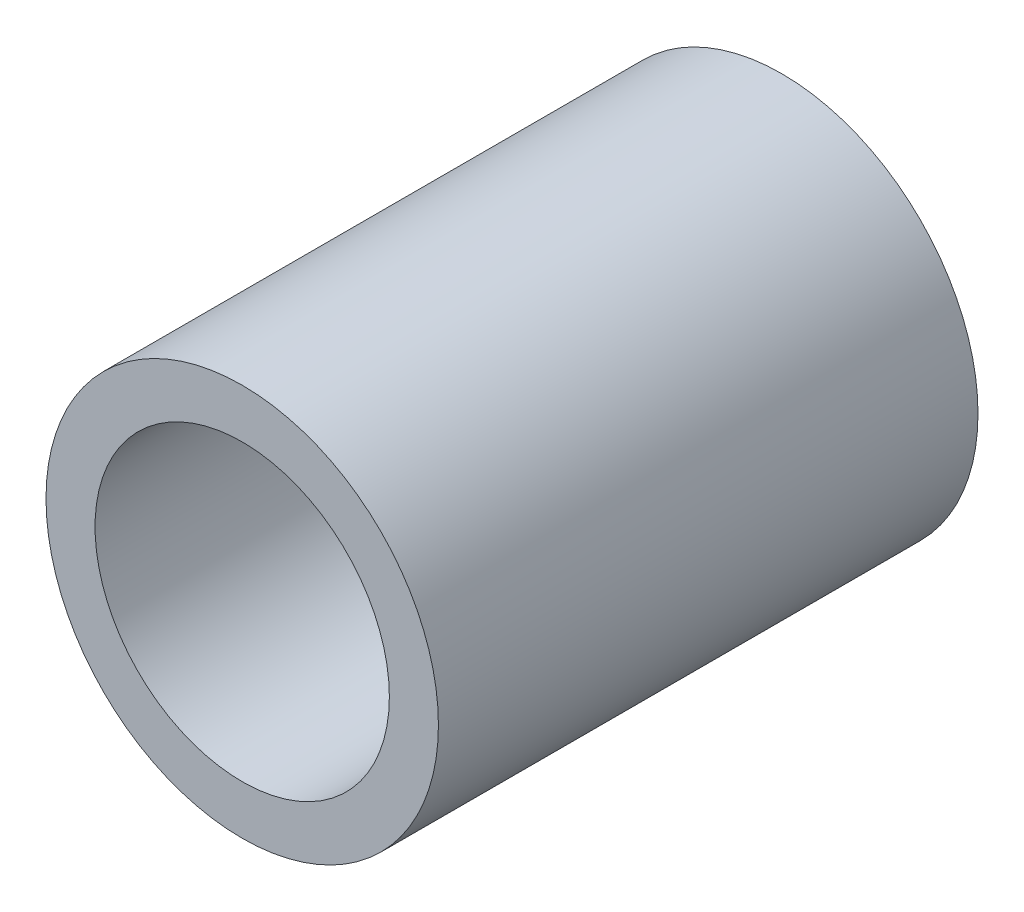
ISO-10303-21;
HEADER;
FILE_DESCRIPTION(('STEP AP214'),'2;1');
FILE_NAME('part.step','',(''),(''),'','','');
FILE_SCHEMA(('AUTOMOTIVE_DESIGN { 1 0 10303 214 1 1 1 1 }'));
ENDSEC;
DATA;
#1=APPLICATION_CONTEXT('core data for automotive mechanical design processes');
#2=APPLICATION_PROTOCOL_DEFINITION('international standard','automotive_design',2000,#1);
#3=PRODUCT_CONTEXT('',#1,'mechanical');
#4=PRODUCT('Part','Part','',(#3));
#5=PRODUCT_RELATED_PRODUCT_CATEGORY('part','',(#4));
#6=PRODUCT_DEFINITION_FORMATION('','',#4);
#7=PRODUCT_DEFINITION_CONTEXT('part definition',#1,'design');
#8=PRODUCT_DEFINITION('design','',#6,#7);
#9=PRODUCT_DEFINITION_SHAPE('','',#8);
#10=(LENGTH_UNIT() NAMED_UNIT(*) SI_UNIT(.MILLI.,.METRE.));
#11=(NAMED_UNIT(*) PLANE_ANGLE_UNIT() SI_UNIT($,.RADIAN.));
#12=(NAMED_UNIT(*) SI_UNIT($,.STERADIAN.) SOLID_ANGLE_UNIT());
#13=UNCERTAINTY_MEASURE_WITH_UNIT(LENGTH_MEASURE(1.E-05),#10,'distance_accuracy_value','');
#14=(GEOMETRIC_REPRESENTATION_CONTEXT(3) GLOBAL_UNCERTAINTY_ASSIGNED_CONTEXT((#13)) GLOBAL_UNIT_ASSIGNED_CONTEXT((#10,
#11,#12)) REPRESENTATION_CONTEXT('',''));
#15=CARTESIAN_POINT('',(0.,0.,0.));
#16=DIRECTION('',(0.,0.,1.));
#17=DIRECTION('',(1.,0.,0.));
#18=AXIS2_PLACEMENT_3D('',#15,#16,#17);
#19=CARTESIAN_POINT('',(0.,0.,11.));
#20=DIRECTION('',(0.,0.,1.));
#21=DIRECTION('',(1.,0.,0.));
#22=AXIS2_PLACEMENT_3D('',#19,#20,#21);
#23=PLANE('',#22);
#24=CARTESIAN_POINT('',(0.,0.,11.));
#25=DIRECTION('',(0.,0.,1.));
#26=DIRECTION('',(1.,0.,0.));
#27=AXIS2_PLACEMENT_3D('',#24,#25,#26);
#28=CIRCLE('',#27,4.);
#29=CARTESIAN_POINT('',(4.,0.,11.));
#30=VERTEX_POINT('',#29);
#31=EDGE_CURVE('E10',#30,#30,#28,.T.);
#32=ORIENTED_EDGE('',*,*,#31,.T.);
#33=EDGE_LOOP('',(#32));
#34=FACE_BOUND('',#33,.T.);
#35=CARTESIAN_POINT('',(0.,0.,11.));
#36=DIRECTION('',(0.,0.,1.));
#37=DIRECTION('',(1.,0.,0.));
#38=AXIS2_PLACEMENT_3D('',#35,#36,#37);
#39=CIRCLE('',#38,3.);
#40=CARTESIAN_POINT('',(3.,0.,11.));
#41=VERTEX_POINT('',#40);
#42=EDGE_CURVE('E35',#41,#41,#39,.T.);
#43=ORIENTED_EDGE('',*,*,#42,.F.);
#44=EDGE_LOOP('',(#43));
#45=FACE_BOUND('',#44,.T.);
#46=ADVANCED_FACE('F24',(#34,#45),#23,.T.);
#47=CARTESIAN_POINT('',(0.,0.,0.));
#48=DIRECTION('',(0.,0.,1.));
#49=DIRECTION('',(1.,0.,0.));
#50=AXIS2_PLACEMENT_3D('',#47,#48,#49);
#51=PLANE('',#50);
#52=CARTESIAN_POINT('',(0.,0.,0.));
#53=DIRECTION('',(0.,0.,1.));
#54=DIRECTION('',(1.,0.,0.));
#55=AXIS2_PLACEMENT_3D('',#52,#53,#54);
#56=CIRCLE('',#55,4.);
#57=CARTESIAN_POINT('',(4.,0.,0.));
#58=VERTEX_POINT('',#57);
#59=EDGE_CURVE('E31',#58,#58,#56,.T.);
#60=ORIENTED_EDGE('',*,*,#59,.F.);
#61=EDGE_LOOP('',(#60));
#62=FACE_BOUND('',#61,.T.);
#63=CARTESIAN_POINT('',(0.,0.,0.));
#64=DIRECTION('',(0.,0.,1.));
#65=DIRECTION('',(1.,0.,0.));
#66=AXIS2_PLACEMENT_3D('',#63,#64,#65);
#67=CIRCLE('',#66,3.);
#68=CARTESIAN_POINT('',(3.,0.,0.));
#69=VERTEX_POINT('',#68);
#70=EDGE_CURVE('E39',#69,#69,#67,.T.);
#71=ORIENTED_EDGE('',*,*,#70,.T.);
#72=EDGE_LOOP('',(#71));
#73=FACE_BOUND('',#72,.T.);
#74=ADVANCED_FACE('F45',(#62,#73),#51,.F.);
#75=CARTESIAN_POINT('',(0.,0.,11.));
#76=DIRECTION('',(0.,0.,-1.));
#77=DIRECTION('',(-1.,0.,0.));
#78=AXIS2_PLACEMENT_3D('',#75,#76,#77);
#79=CYLINDRICAL_SURFACE('',#78,4.);
#80=ORIENTED_EDGE('',*,*,#31,.F.);
#81=EDGE_LOOP('',(#80));
#82=FACE_BOUND('',#81,.T.);
#83=ORIENTED_EDGE('',*,*,#59,.T.);
#84=EDGE_LOOP('',(#83));
#85=FACE_BOUND('',#84,.T.);
#86=ADVANCED_FACE('F26',(#82,#85),#79,.T.);
#87=CARTESIAN_POINT('',(0.,0.,11.));
#88=DIRECTION('',(0.,0.,-1.));
#89=DIRECTION('',(-1.,0.,0.));
#90=AXIS2_PLACEMENT_3D('',#87,#88,#89);
#91=CYLINDRICAL_SURFACE('',#90,3.);
#92=ORIENTED_EDGE('',*,*,#42,.T.);
#93=EDGE_LOOP('',(#92));
#94=FACE_BOUND('',#93,.T.);
#95=ORIENTED_EDGE('',*,*,#70,.F.);
#96=EDGE_LOOP('',(#95));
#97=FACE_BOUND('',#96,.T.);
#98=ADVANCED_FACE('F47',(#94,#97),#91,.F.);
#99=CLOSED_SHELL('',(#46,#74,#86,#98));
#100=MANIFOLD_SOLID_BREP('B2',#99);
#101=ADVANCED_BREP_SHAPE_REPRESENTATION('',(#18,#100),#14);
#102=SHAPE_DEFINITION_REPRESENTATION(#9,#101);
ENDSEC;
END-ISO-10303-21;
